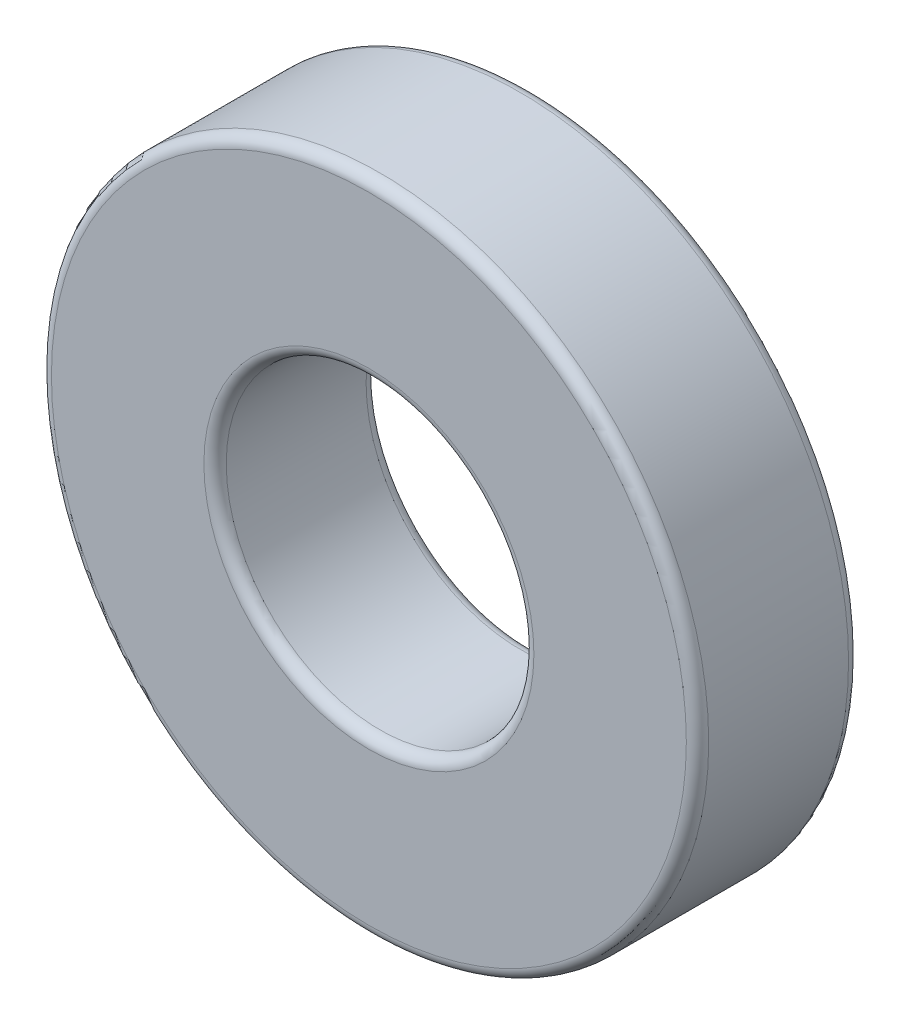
ISO-10303-21;
HEADER;
FILE_DESCRIPTION(('STEP AP214'),'2;1');
FILE_NAME('part.step','',(''),(''),'','','');
FILE_SCHEMA(('AUTOMOTIVE_DESIGN { 1 0 10303 214 1 1 1 1 }'));
ENDSEC;
DATA;
#1=APPLICATION_CONTEXT('core data for automotive mechanical design processes');
#2=APPLICATION_PROTOCOL_DEFINITION('international standard','automotive_design',2000,#1);
#3=PRODUCT_CONTEXT('',#1,'mechanical');
#4=PRODUCT('Part','Part','',(#3));
#5=PRODUCT_RELATED_PRODUCT_CATEGORY('part','',(#4));
#6=PRODUCT_DEFINITION_FORMATION('','',#4);
#7=PRODUCT_DEFINITION_CONTEXT('part definition',#1,'design');
#8=PRODUCT_DEFINITION('design','',#6,#7);
#9=PRODUCT_DEFINITION_SHAPE('','',#8);
#10=(LENGTH_UNIT() NAMED_UNIT(*) SI_UNIT(.MILLI.,.METRE.));
#11=(NAMED_UNIT(*) PLANE_ANGLE_UNIT() SI_UNIT($,.RADIAN.));
#12=(NAMED_UNIT(*) SI_UNIT($,.STERADIAN.) SOLID_ANGLE_UNIT());
#13=UNCERTAINTY_MEASURE_WITH_UNIT(LENGTH_MEASURE(1.E-05),#10,'distance_accuracy_value','');
#14=(GEOMETRIC_REPRESENTATION_CONTEXT(3) GLOBAL_UNCERTAINTY_ASSIGNED_CONTEXT((#13)) GLOBAL_UNIT_ASSIGNED_CONTEXT((#10,
#11,#12)) REPRESENTATION_CONTEXT('',''));
#15=CARTESIAN_POINT('',(0.,0.,0.));
#16=DIRECTION('',(0.,0.,1.));
#17=DIRECTION('',(1.,0.,0.));
#18=AXIS2_PLACEMENT_3D('',#15,#16,#17);
#19=CARTESIAN_POINT('',(0.,0.,-2.));
#20=DIRECTION('',(0.,0.,1.));
#21=DIRECTION('',(1.,0.,0.));
#22=AXIS2_PLACEMENT_3D('',#19,#20,#21);
#23=TOROIDAL_SURFACE('',#22,56.75,2.);
#24=CARTESIAN_POINT('',(0.,0.,-2.));
#25=DIRECTION('',(0.,0.,1.));
#26=DIRECTION('',(1.,0.,0.));
#27=AXIS2_PLACEMENT_3D('',#24,#25,#26);
#28=CIRCLE('',#27,58.75);
#29=CARTESIAN_POINT('',(58.75,0.,-2.));
#30=VERTEX_POINT('',#29);
#31=EDGE_CURVE('E10',#30,#30,#28,.T.);
#32=ORIENTED_EDGE('',*,*,#31,.T.);
#33=EDGE_LOOP('',(#32));
#34=FACE_BOUND('',#33,.T.);
#35=CARTESIAN_POINT('',(0.,0.,0.));
#36=DIRECTION('',(0.,0.,1.));
#37=DIRECTION('',(1.,0.,0.));
#38=AXIS2_PLACEMENT_3D('',#35,#36,#37);
#39=CIRCLE('',#38,56.75);
#40=CARTESIAN_POINT('',(56.75,0.,0.));
#41=VERTEX_POINT('',#40);
#42=EDGE_CURVE('E60',#41,#41,#39,.T.);
#43=ORIENTED_EDGE('',*,*,#42,.F.);
#44=EDGE_LOOP('',(#43));
#45=FACE_BOUND('',#44,.T.);
#46=ADVANCED_FACE('F32',(#34,#45),#23,.T.);
#47=CARTESIAN_POINT('',(0.,0.,33.1757165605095));
#48=DIRECTION('',(0.,0.,1.));
#49=DIRECTION('',(1.,0.,0.));
#50=AXIS2_PLACEMENT_3D('',#47,#48,#49);
#51=CYLINDRICAL_SURFACE('',#50,58.75);
#52=CARTESIAN_POINT('',(0.,0.,-27.));
#53=DIRECTION('',(0.,0.,1.));
#54=DIRECTION('',(1.,0.,0.));
#55=AXIS2_PLACEMENT_3D('',#52,#53,#54);
#56=CIRCLE('',#55,58.75);
#57=CARTESIAN_POINT('',(58.75,0.,-27.));
#58=VERTEX_POINT('',#57);
#59=EDGE_CURVE('E38',#58,#58,#56,.T.);
#60=ORIENTED_EDGE('',*,*,#59,.T.);
#61=EDGE_LOOP('',(#60));
#62=FACE_BOUND('',#61,.T.);
#63=ORIENTED_EDGE('',*,*,#31,.F.);
#64=EDGE_LOOP('',(#63));
#65=FACE_BOUND('',#64,.T.);
#66=ADVANCED_FACE('F162',(#62,#65),#51,.T.);
#67=CARTESIAN_POINT('',(0.,0.,-27.));
#68=DIRECTION('',(0.,0.,1.));
#69=DIRECTION('',(1.,0.,0.));
#70=AXIS2_PLACEMENT_3D('',#67,#68,#69);
#71=TOROIDAL_SURFACE('',#70,56.75,2.00000000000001);
#72=ORIENTED_EDGE('',*,*,#59,.F.);
#73=EDGE_LOOP('',(#72));
#74=FACE_BOUND('',#73,.T.);
#75=CARTESIAN_POINT('',(0.,0.,-29.));
#76=DIRECTION('',(0.,0.,1.));
#77=DIRECTION('',(1.,0.,0.));
#78=AXIS2_PLACEMENT_3D('',#75,#76,#77);
#79=CIRCLE('',#78,56.75);
#80=CARTESIAN_POINT('',(56.75,0.,-29.));
#81=VERTEX_POINT('',#80);
#82=EDGE_CURVE('E42',#81,#81,#79,.T.);
#83=ORIENTED_EDGE('',*,*,#82,.T.);
#84=EDGE_LOOP('',(#83));
#85=FACE_BOUND('',#84,.T.);
#86=ADVANCED_FACE('F159',(#74,#85),#71,.T.);
#87=CARTESIAN_POINT('',(0.,56.75,-29.));
#88=DIRECTION('',(0.,0.,-1.));
#89=DIRECTION('',(-1.,0.,0.));
#90=AXIS2_PLACEMENT_3D('',#87,#88,#89);
#91=PLANE('',#90);
#92=CARTESIAN_POINT('',(0.,0.,-29.));
#93=DIRECTION('',(0.,0.,1.));
#94=DIRECTION('',(1.,0.,0.));
#95=AXIS2_PLACEMENT_3D('',#92,#93,#94);
#96=CIRCLE('',#95,29.5);
#97=CARTESIAN_POINT('',(29.5,0.,-29.));
#98=VERTEX_POINT('',#97);
#99=EDGE_CURVE('E46',#98,#98,#96,.T.);
#100=ORIENTED_EDGE('',*,*,#99,.T.);
#101=EDGE_LOOP('',(#100));
#102=FACE_BOUND('',#101,.T.);
#103=ORIENTED_EDGE('',*,*,#82,.F.);
#104=EDGE_LOOP('',(#103));
#105=FACE_BOUND('',#104,.T.);
#106=ADVANCED_FACE('F155',(#102,#105),#91,.T.);
#107=CARTESIAN_POINT('',(0.,0.,-27.));
#108=DIRECTION('',(0.,0.,1.));
#109=DIRECTION('',(1.,0.,0.));
#110=AXIS2_PLACEMENT_3D('',#107,#108,#109);
#111=TOROIDAL_SURFACE('',#110,29.5,2.);
#112=CARTESIAN_POINT('',(0.,0.,-27.));
#113=DIRECTION('',(0.,0.,1.));
#114=DIRECTION('',(1.,0.,0.));
#115=AXIS2_PLACEMENT_3D('',#112,#113,#114);
#116=CIRCLE('',#115,27.5);
#117=CARTESIAN_POINT('',(27.5,0.,-27.));
#118=VERTEX_POINT('',#117);
#119=EDGE_CURVE('E51',#118,#118,#116,.T.);
#120=ORIENTED_EDGE('',*,*,#119,.T.);
#121=EDGE_LOOP('',(#120));
#122=FACE_BOUND('',#121,.T.);
#123=ORIENTED_EDGE('',*,*,#99,.F.);
#124=EDGE_LOOP('',(#123));
#125=FACE_BOUND('',#124,.T.);
#126=ADVANCED_FACE('F151',(#122,#125),#111,.T.);
#127=CARTESIAN_POINT('',(0.,0.,33.1757165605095));
#128=DIRECTION('',(0.,0.,1.));
#129=DIRECTION('',(1.,0.,0.));
#130=AXIS2_PLACEMENT_3D('',#127,#128,#129);
#131=CYLINDRICAL_SURFACE('',#130,27.5);
#132=CARTESIAN_POINT('',(0.,0.,-2.));
#133=DIRECTION('',(0.,0.,1.));
#134=DIRECTION('',(1.,0.,0.));
#135=AXIS2_PLACEMENT_3D('',#132,#133,#134);
#136=CIRCLE('',#135,27.5);
#137=CARTESIAN_POINT('',(27.5,0.,-2.));
#138=VERTEX_POINT('',#137);
#139=EDGE_CURVE('E54',#138,#138,#136,.T.);
#140=ORIENTED_EDGE('',*,*,#139,.T.);
#141=EDGE_LOOP('',(#140));
#142=FACE_BOUND('',#141,.T.);
#143=ORIENTED_EDGE('',*,*,#119,.F.);
#144=EDGE_LOOP('',(#143));
#145=FACE_BOUND('',#144,.T.);
#146=ADVANCED_FACE('F147',(#142,#145),#131,.F.);
#147=CARTESIAN_POINT('',(0.,0.,-2.));
#148=DIRECTION('',(0.,0.,1.));
#149=DIRECTION('',(1.,0.,0.));
#150=AXIS2_PLACEMENT_3D('',#147,#148,#149);
#151=TOROIDAL_SURFACE('',#150,29.5,2.);
#152=CARTESIAN_POINT('',(0.,0.,0.));
#153=DIRECTION('',(0.,0.,1.));
#154=DIRECTION('',(1.,0.,0.));
#155=AXIS2_PLACEMENT_3D('',#152,#153,#154);
#156=CIRCLE('',#155,29.5);
#157=CARTESIAN_POINT('',(29.5,0.,0.));
#158=VERTEX_POINT('',#157);
#159=EDGE_CURVE('E57',#158,#158,#156,.T.);
#160=ORIENTED_EDGE('',*,*,#159,.T.);
#161=EDGE_LOOP('',(#160));
#162=FACE_BOUND('',#161,.T.);
#163=ORIENTED_EDGE('',*,*,#139,.F.);
#164=EDGE_LOOP('',(#163));
#165=FACE_BOUND('',#164,.T.);
#166=ADVANCED_FACE('F143',(#162,#165),#151,.T.);
#167=CARTESIAN_POINT('',(0.,29.5,0.));
#168=DIRECTION('',(0.,0.,1.));
#169=DIRECTION('',(1.,0.,0.));
#170=AXIS2_PLACEMENT_3D('',#167,#168,#169);
#171=PLANE('',#170);
#172=ORIENTED_EDGE('',*,*,#42,.T.);
#173=EDGE_LOOP('',(#172));
#174=FACE_BOUND('',#173,.T.);
#175=ORIENTED_EDGE('',*,*,#159,.F.);
#176=EDGE_LOOP('',(#175));
#177=FACE_BOUND('',#176,.T.);
#178=ADVANCED_FACE('F141',(#174,#177),#171,.T.);
#179=CLOSED_SHELL('',(#46,#66,#86,#106,#126,#146,#166,#178));
#180=CARTESIAN_POINT('',(0.,50.9375,-14.485));
#181=DIRECTION('',(0.,0.,1.));
#182=DIRECTION('',(1.,0.,0.));
#183=AXIS2_PLACEMENT_3D('',#180,#181,#182);
#184=PLANE('',#183);
#185=CARTESIAN_POINT('',(0.,0.,-14.485));
#186=DIRECTION('',(0.,0.,1.));
#187=DIRECTION('',(1.,0.,0.));
#188=AXIS2_PLACEMENT_3D('',#185,#186,#187);
#189=CIRCLE('',#188,50.9475);
#190=CARTESIAN_POINT('',(50.9475,0.,-14.485));
#191=VERTEX_POINT('',#190);
#192=EDGE_CURVE('E63',#191,#191,#189,.T.);
#193=ORIENTED_EDGE('',*,*,#192,.F.);
#194=EDGE_LOOP('',(#193));
#195=FACE_BOUND('',#194,.T.);
#196=CARTESIAN_POINT('',(0.,0.,-14.485));
#197=DIRECTION('',(0.,0.,1.));
#198=DIRECTION('',(1.,0.,0.));
#199=AXIS2_PLACEMENT_3D('',#196,#197,#198);
#200=CIRCLE('',#199,43.14);
#201=CARTESIAN_POINT('',(43.14,0.,-14.485));
#202=VERTEX_POINT('',#201);
#203=EDGE_CURVE('E96',#202,#202,#200,.T.);
#204=ORIENTED_EDGE('',*,*,#203,.T.);
#205=EDGE_LOOP('',(#204));
#206=FACE_BOUND('',#205,.T.);
#207=ADVANCED_FACE('F100',(#195,#206),#184,.F.);
#208=CARTESIAN_POINT('',(0.,0.,8.31184503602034));
#209=DIRECTION('',(0.,0.,1.));
#210=DIRECTION('',(1.,0.,0.));
#211=AXIS2_PLACEMENT_3D('',#208,#209,#210);
#212=CYLINDRICAL_SURFACE('',#211,50.9475);
#213=CARTESIAN_POINT('',(0.,0.,-14.515));
#214=DIRECTION('',(0.,0.,1.));
#215=DIRECTION('',(1.,0.,0.));
#216=AXIS2_PLACEMENT_3D('',#213,#214,#215);
#217=CIRCLE('',#216,50.9475);
#218=CARTESIAN_POINT('',(50.9475,0.,-14.515));
#219=VERTEX_POINT('',#218);
#220=EDGE_CURVE('E66',#219,#219,#217,.T.);
#221=ORIENTED_EDGE('',*,*,#220,.F.);
#222=EDGE_LOOP('',(#221));
#223=FACE_BOUND('',#222,.T.);
#224=ORIENTED_EDGE('',*,*,#192,.T.);
#225=EDGE_LOOP('',(#224));
#226=FACE_BOUND('',#225,.T.);
#227=ADVANCED_FACE('F128',(#223,#226),#212,.F.);
#228=CARTESIAN_POINT('',(0.,50.9375,-14.515));
#229=DIRECTION('',(0.,0.,1.));
#230=DIRECTION('',(1.,0.,0.));
#231=AXIS2_PLACEMENT_3D('',#228,#229,#230);
#232=PLANE('',#231);
#233=ORIENTED_EDGE('',*,*,#220,.T.);
#234=EDGE_LOOP('',(#233));
#235=FACE_BOUND('',#234,.T.);
#236=CARTESIAN_POINT('',(0.,0.,-14.515));
#237=DIRECTION('',(0.,0.,1.));
#238=DIRECTION('',(1.,0.,0.));
#239=AXIS2_PLACEMENT_3D('',#236,#237,#238);
#240=CIRCLE('',#239,43.14);
#241=CARTESIAN_POINT('',(43.14,0.,-14.515));
#242=VERTEX_POINT('',#241);
#243=EDGE_CURVE('E69',#242,#242,#240,.T.);
#244=ORIENTED_EDGE('',*,*,#243,.F.);
#245=EDGE_LOOP('',(#244));
#246=FACE_BOUND('',#245,.T.);
#247=ADVANCED_FACE('F135',(#235,#246),#232,.T.);
#248=CARTESIAN_POINT('',(0.,0.,8.31184503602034));
#249=DIRECTION('',(0.,0.,1.));
#250=DIRECTION('',(1.,0.,0.));
#251=AXIS2_PLACEMENT_3D('',#248,#249,#250);
#252=CYLINDRICAL_SURFACE('',#251,43.14);
#253=ORIENTED_EDGE('',*,*,#243,.T.);
#254=EDGE_LOOP('',(#253));
#255=FACE_BOUND('',#254,.T.);
#256=CARTESIAN_POINT('',(0.,0.,-26.11));
#257=DIRECTION('',(0.,0.,1.));
#258=DIRECTION('',(1.,0.,0.));
#259=AXIS2_PLACEMENT_3D('',#256,#257,#258);
#260=CIRCLE('',#259,43.14);
#261=CARTESIAN_POINT('',(43.14,0.,-26.11));
#262=VERTEX_POINT('',#261);
#263=EDGE_CURVE('E72',#262,#262,#260,.T.);
#264=ORIENTED_EDGE('',*,*,#263,.F.);
#265=EDGE_LOOP('',(#264));
#266=FACE_BOUND('',#265,.T.);
#267=ADVANCED_FACE('F243',(#255,#266),#252,.F.);
#268=CARTESIAN_POINT('',(0.,50.9375,-26.11));
#269=DIRECTION('',(0.,0.,1.));
#270=DIRECTION('',(1.,0.,0.));
#271=AXIS2_PLACEMENT_3D('',#268,#269,#270);
#272=PLANE('',#271);
#273=ORIENTED_EDGE('',*,*,#263,.T.);
#274=EDGE_LOOP('',(#273));
#275=FACE_BOUND('',#274,.T.);
#276=CARTESIAN_POINT('',(0.,0.,-26.11));
#277=DIRECTION('',(0.,0.,1.));
#278=DIRECTION('',(1.,0.,0.));
#279=AXIS2_PLACEMENT_3D('',#276,#277,#278);
#280=CIRCLE('',#279,43.11);
#281=CARTESIAN_POINT('',(43.11,0.,-26.11));
#282=VERTEX_POINT('',#281);
#283=EDGE_CURVE('E75',#282,#282,#280,.T.);
#284=ORIENTED_EDGE('',*,*,#283,.F.);
#285=EDGE_LOOP('',(#284));
#286=FACE_BOUND('',#285,.T.);
#287=ADVANCED_FACE('F252',(#275,#286),#272,.T.);
#288=CARTESIAN_POINT('',(0.,0.,8.31184503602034));
#289=DIRECTION('',(0.,0.,1.));
#290=DIRECTION('',(1.,0.,0.));
#291=AXIS2_PLACEMENT_3D('',#288,#289,#290);
#292=CYLINDRICAL_SURFACE('',#291,43.11);
#293=CARTESIAN_POINT('',(0.,0.,-14.515));
#294=DIRECTION('',(0.,0.,1.));
#295=DIRECTION('',(1.,0.,0.));
#296=AXIS2_PLACEMENT_3D('',#293,#294,#295);
#297=CIRCLE('',#296,43.11);
#298=CARTESIAN_POINT('',(43.11,0.,-14.515));
#299=VERTEX_POINT('',#298);
#300=EDGE_CURVE('E78',#299,#299,#297,.T.);
#301=ORIENTED_EDGE('',*,*,#300,.F.);
#302=EDGE_LOOP('',(#301));
#303=FACE_BOUND('',#302,.T.);
#304=ORIENTED_EDGE('',*,*,#283,.T.);
#305=EDGE_LOOP('',(#304));
#306=FACE_BOUND('',#305,.T.);
#307=ADVANCED_FACE('F262',(#303,#306),#292,.T.);
#308=CARTESIAN_POINT('',(0.,50.9375,-14.515));
#309=DIRECTION('',(0.,0.,-1.));
#310=DIRECTION('',(-1.,0.,0.));
#311=AXIS2_PLACEMENT_3D('',#308,#309,#310);
#312=PLANE('',#311);
#313=CARTESIAN_POINT('',(0.,0.,-14.515));
#314=DIRECTION('',(0.,0.,1.));
#315=DIRECTION('',(1.,0.,0.));
#316=AXIS2_PLACEMENT_3D('',#313,#314,#315);
#317=CIRCLE('',#316,35.3025);
#318=CARTESIAN_POINT('',(35.3025,0.,-14.515));
#319=VERTEX_POINT('',#318);
#320=EDGE_CURVE('E81',#319,#319,#317,.T.);
#321=ORIENTED_EDGE('',*,*,#320,.F.);
#322=EDGE_LOOP('',(#321));
#323=FACE_BOUND('',#322,.T.);
#324=ORIENTED_EDGE('',*,*,#300,.T.);
#325=EDGE_LOOP('',(#324));
#326=FACE_BOUND('',#325,.T.);
#327=ADVANCED_FACE('F272',(#323,#326),#312,.F.);
#328=CARTESIAN_POINT('',(0.,0.,8.31184503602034));
#329=DIRECTION('',(0.,0.,1.));
#330=DIRECTION('',(1.,0.,0.));
#331=AXIS2_PLACEMENT_3D('',#328,#329,#330);
#332=CYLINDRICAL_SURFACE('',#331,35.3025);
#333=ORIENTED_EDGE('',*,*,#320,.T.);
#334=EDGE_LOOP('',(#333));
#335=FACE_BOUND('',#334,.T.);
#336=CARTESIAN_POINT('',(0.,0.,-14.485));
#337=DIRECTION('',(0.,0.,1.));
#338=DIRECTION('',(1.,0.,0.));
#339=AXIS2_PLACEMENT_3D('',#336,#337,#338);
#340=CIRCLE('',#339,35.3025);
#341=CARTESIAN_POINT('',(35.3025,0.,-14.485));
#342=VERTEX_POINT('',#341);
#343=EDGE_CURVE('E84',#342,#342,#340,.T.);
#344=ORIENTED_EDGE('',*,*,#343,.F.);
#345=EDGE_LOOP('',(#344));
#346=FACE_BOUND('',#345,.T.);
#347=ADVANCED_FACE('F123',(#335,#346),#332,.T.);
#348=CARTESIAN_POINT('',(0.,50.9375,-14.485));
#349=DIRECTION('',(0.,0.,-1.));
#350=DIRECTION('',(-1.,0.,0.));
#351=AXIS2_PLACEMENT_3D('',#348,#349,#350);
#352=PLANE('',#351);
#353=ORIENTED_EDGE('',*,*,#343,.T.);
#354=EDGE_LOOP('',(#353));
#355=FACE_BOUND('',#354,.T.);
#356=CARTESIAN_POINT('',(0.,0.,-14.485));
#357=DIRECTION('',(0.,0.,1.));
#358=DIRECTION('',(1.,0.,0.));
#359=AXIS2_PLACEMENT_3D('',#356,#357,#358);
#360=CIRCLE('',#359,43.11);
#361=CARTESIAN_POINT('',(43.11,0.,-14.485));
#362=VERTEX_POINT('',#361);
#363=EDGE_CURVE('E87',#362,#362,#360,.T.);
#364=ORIENTED_EDGE('',*,*,#363,.F.);
#365=EDGE_LOOP('',(#364));
#366=FACE_BOUND('',#365,.T.);
#367=ADVANCED_FACE('F117',(#355,#366),#352,.T.);
#368=CARTESIAN_POINT('',(0.,0.,8.31184503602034));
#369=DIRECTION('',(0.,0.,1.));
#370=DIRECTION('',(1.,0.,0.));
#371=AXIS2_PLACEMENT_3D('',#368,#369,#370);
#372=CYLINDRICAL_SURFACE('',#371,43.11);
#373=ORIENTED_EDGE('',*,*,#363,.T.);
#374=EDGE_LOOP('',(#373));
#375=FACE_BOUND('',#374,.T.);
#376=CARTESIAN_POINT('',(0.,0.,-2.88999999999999));
#377=DIRECTION('',(0.,0.,1.));
#378=DIRECTION('',(1.,0.,0.));
#379=AXIS2_PLACEMENT_3D('',#376,#377,#378);
#380=CIRCLE('',#379,43.11);
#381=CARTESIAN_POINT('',(43.11,0.,-2.88999999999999));
#382=VERTEX_POINT('',#381);
#383=EDGE_CURVE('E90',#382,#382,#380,.T.);
#384=ORIENTED_EDGE('',*,*,#383,.F.);
#385=EDGE_LOOP('',(#384));
#386=FACE_BOUND('',#385,.T.);
#387=ADVANCED_FACE('F112',(#375,#386),#372,.T.);
#388=CARTESIAN_POINT('',(0.,50.9375,-2.88999999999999));
#389=DIRECTION('',(0.,0.,1.));
#390=DIRECTION('',(1.,0.,0.));
#391=AXIS2_PLACEMENT_3D('',#388,#389,#390);
#392=PLANE('',#391);
#393=CARTESIAN_POINT('',(0.,0.,-2.88999999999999));
#394=DIRECTION('',(0.,0.,1.));
#395=DIRECTION('',(1.,0.,0.));
#396=AXIS2_PLACEMENT_3D('',#393,#394,#395);
#397=CIRCLE('',#396,43.14);
#398=CARTESIAN_POINT('',(43.14,0.,-2.88999999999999));
#399=VERTEX_POINT('',#398);
#400=EDGE_CURVE('E93',#399,#399,#397,.T.);
#401=ORIENTED_EDGE('',*,*,#400,.F.);
#402=EDGE_LOOP('',(#401));
#403=FACE_BOUND('',#402,.T.);
#404=ORIENTED_EDGE('',*,*,#383,.T.);
#405=EDGE_LOOP('',(#404));
#406=FACE_BOUND('',#405,.T.);
#407=ADVANCED_FACE('F105',(#403,#406),#392,.F.);
#408=CARTESIAN_POINT('',(0.,0.,8.31184503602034));
#409=DIRECTION('',(0.,0.,1.));
#410=DIRECTION('',(1.,0.,0.));
#411=AXIS2_PLACEMENT_3D('',#408,#409,#410);
#412=CYLINDRICAL_SURFACE('',#411,43.14);
#413=ORIENTED_EDGE('',*,*,#203,.F.);
#414=EDGE_LOOP('',(#413));
#415=FACE_BOUND('',#414,.T.);
#416=ORIENTED_EDGE('',*,*,#400,.T.);
#417=EDGE_LOOP('',(#416));
#418=FACE_BOUND('',#417,.T.);
#419=ADVANCED_FACE('F102',(#415,#418),#412,.F.);
#420=CLOSED_SHELL('',(#207,#227,#247,#267,#287,#307,#327,#347,#367,#387,#407,#419));
#421=ORIENTED_CLOSED_SHELL('',*,#420,.T.);
#422=BREP_WITH_VOIDS('B2',#179,(#421));
#423=ADVANCED_BREP_SHAPE_REPRESENTATION('',(#18,#422),#14);
#424=SHAPE_DEFINITION_REPRESENTATION(#9,#423);
ENDSEC;
END-ISO-10303-21;
